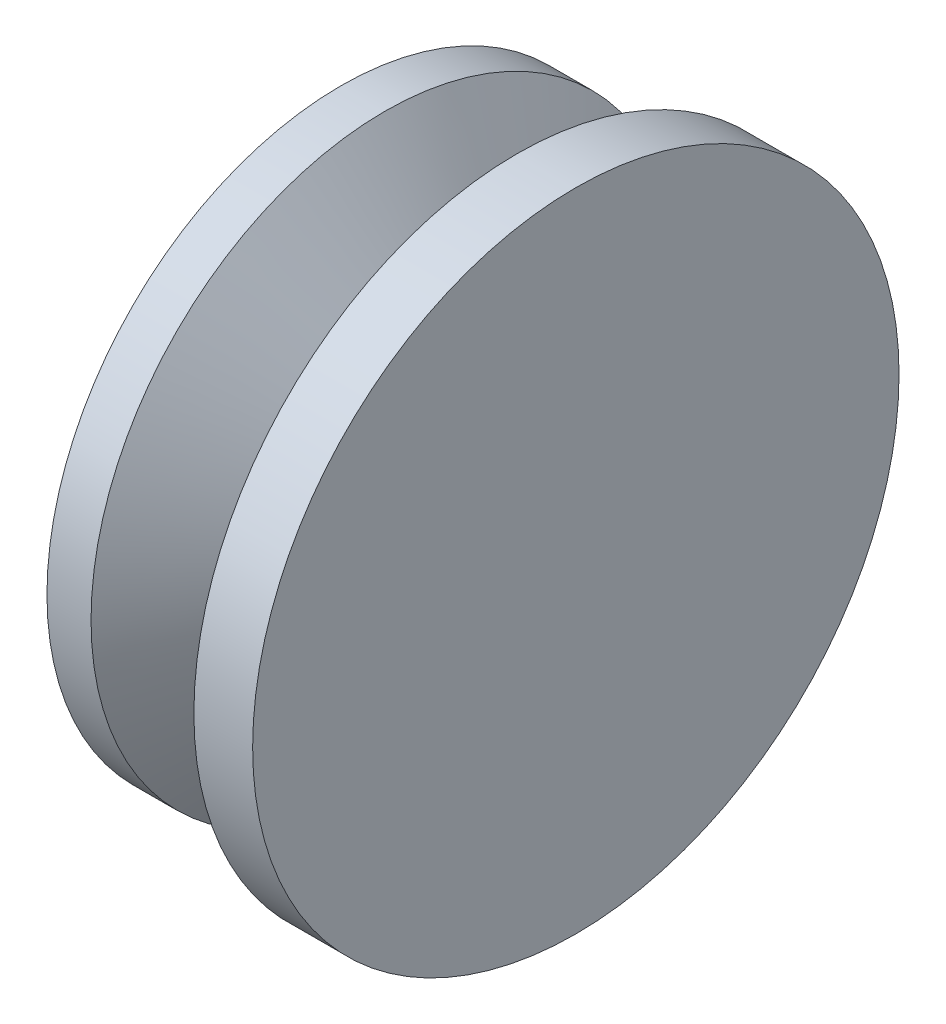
from build123d import *


with BuildPart() as part:
    # Sketch 1 → Revolve 1 (revolve)
    with BuildSketch(Plane.XY.offset(25), mode=Mode.PRIVATE) as revolve_1_sk:
        Polygon((51, 39), (51, 49), (52.5, 49), (54.5, 46.004139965), (57, 46.004139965), (57, 50), (59, 50), (59, 39), align=None)
    revolve(revolve_1_sk.sketch.rotate(Axis((58, 39, 25), (-1, 0, 0)), 90), axis=Axis((58, 39, 25), (-1, 0, 0)))


solid = part.part
